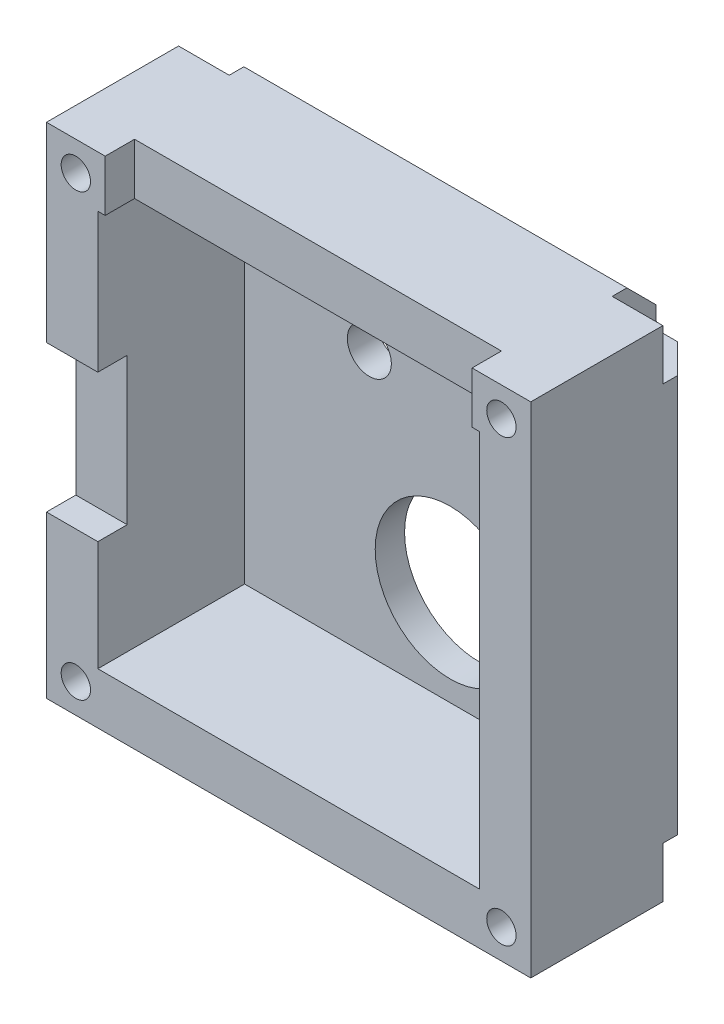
from build123d import *

# Parameters (mm, degrees)
SKETCH1_W           = 33
SKETCH1_H           = 34
SKETCH1_W_2         = 26
SKETCH1_H_2         = 27
BOSS_EXTRUDE1_DEPTH = 10
SKETCH2_W           = 33
SKETCH2_H           = 34
BOSS_EXTRUDE2_DEPTH = 2
SKETCH3_R           = 1
CUT_EXTRUDE1_DEPTH  = 21
SKETCH4_W           = 3.45
SKETCH4_H           = 3.45
CUT_EXTRUDE2_DEPTH  = 3
CHAMFER1_SIZE       = 2
FILLET1_R           = 0.5
SKETCH5_W           = 25
SKETCH5_H           = 4
CUT_EXTRUDE3_DEPTH  = 8
SKETCH6_W           = 4
SKETCH6_H           = 10
CUT_EXTRUDE4_DEPTH  = 8
SKETCH7_R           = 1.5
SKETCH7_R_2         = 5.1
CUT_EXTRUDE5_DEPTH  = 8


with BuildPart() as part:
    # Sketch1 → Boss-Extrude1 (new body)
    with BuildSketch(Plane.XY):
        Rectangle(SKETCH1_W, SKETCH1_H)
        Rectangle(SKETCH1_W_2, SKETCH1_H_2, mode=Mode.SUBTRACT)
    extrude(amount=BOSS_EXTRUDE1_DEPTH)

    # Sketch2 → Boss-Extrude2 (add)
    with BuildSketch(Plane(origin=(0, 0, 0), x_dir=(-1, 0, 0), z_dir=(0, 0, -1))):
        Rectangle(SKETCH2_W, SKETCH2_H)
    extrude(amount=BOSS_EXTRUDE2_DEPTH)

    # Sketch3 → Cut-Extrude1 (cut)
    with BuildSketch(Plane(origin=(0, 0, -2), x_dir=(-1, 0, 0), z_dir=(0, 0, -1))):
        with Locations((-14.5, 15)):
            Circle(SKETCH3_R)
        with Locations((14.5, 15)):
            Circle(SKETCH3_R)
        with Locations((14.5, -15)):
            Circle(SKETCH3_R)
        with Locations((-14.5, -15)):
            Circle(SKETCH3_R)
    extrude(amount=-CUT_EXTRUDE1_DEPTH, mode=Mode.SUBTRACT)

    # Sketch4 → Cut-Extrude2 (cut)
    with BuildSketch(Plane(origin=(0, 0, -2), x_dir=(-1, 0, 0), z_dir=(0, 0, -1))):
        with Locations((-14.775, 15.275)):
            Rectangle(SKETCH4_W, SKETCH4_H)
        with Locations((14.775, 15.275)):
            Rectangle(SKETCH4_W, SKETCH4_H)
        with Locations((14.775, -15.275)):
            Rectangle(SKETCH4_W, SKETCH4_H)
        with Locations((-14.775, -15.275)):
            Rectangle(SKETCH4_W, SKETCH4_H)
    extrude(amount=-CUT_EXTRUDE2_DEPTH, mode=Mode.SUBTRACT)

    # Chamfer1
    chamfer1_edges = [part.edges().sort_by_distance(p)[0] for p in [
        (-16.5, 0, -2),
        (0, 17, -2),
        (16.5, 0, -2),
        (0, -17, -2),
    ]]
    chamfer(chamfer1_edges, length=CHAMFER1_SIZE)

    # Fillet1
    fillet1_edges = [part.edges().sort_by_distance(p)[0] for p in [
        (-13.05, 13.55, -0.5),
        (13.05, 13.55, -0.5),
        (13.05, -13.55, -0.5),
        (-13.05, -13.55, -0.5),
    ]]
    fillet(fillet1_edges, radius=FILLET1_R)

    # Sketch5 → Cut-Extrude3 (cut)
    with BuildSketch(Plane(origin=(0, 17, 0), x_dir=(1, 0, 0), z_dir=(0, 1, 0))):
        with Locations((0, -10)):
            Rectangle(SKETCH5_W, SKETCH5_H)
    extrude(amount=-CUT_EXTRUDE3_DEPTH, mode=Mode.SUBTRACT)

    # Sketch6 → Cut-Extrude4 (cut)
    with BuildSketch(Plane.ZY.offset(16.5)):
        with Locations((10, -1)):
            Rectangle(SKETCH6_W, SKETCH6_H)
    extrude(amount=-CUT_EXTRUDE4_DEPTH, mode=Mode.SUBTRACT)

    # Sketch7 → Cut-Extrude5 (cut)
    with BuildSketch(Plane(origin=(0, 0, -2), x_dir=(-1, 0, 0), z_dir=(0, 0, -1))):
        with Locations((4.5, 4.5)):
            Circle(SKETCH7_R)
        with Locations((-10.5, 5.5)):
            Circle(SKETCH7_R)
        with Locations((-1, -7)):
            Circle(SKETCH7_R_2)
    extrude(amount=-CUT_EXTRUDE5_DEPTH, mode=Mode.SUBTRACT)


solid = part.part
